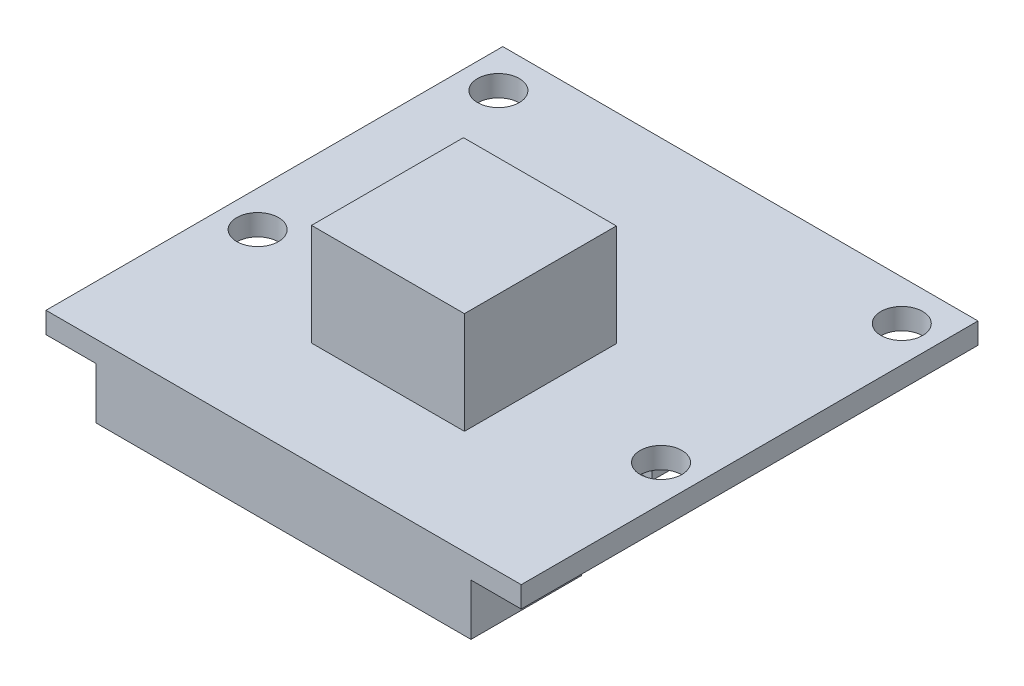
ISO-10303-21;
HEADER;
FILE_DESCRIPTION(('STEP AP214'),'2;1');
FILE_NAME('part.step','',(''),(''),'','','');
FILE_SCHEMA(('AUTOMOTIVE_DESIGN { 1 0 10303 214 1 1 1 1 }'));
ENDSEC;
DATA;
#1=APPLICATION_CONTEXT('core data for automotive mechanical design processes');
#2=APPLICATION_PROTOCOL_DEFINITION('international standard','automotive_design',2000,#1);
#3=PRODUCT_CONTEXT('',#1,'mechanical');
#4=PRODUCT('Part','Part','',(#3));
#5=PRODUCT_RELATED_PRODUCT_CATEGORY('part','',(#4));
#6=PRODUCT_DEFINITION_FORMATION('','',#4);
#7=PRODUCT_DEFINITION_CONTEXT('part definition',#1,'design');
#8=PRODUCT_DEFINITION('design','',#6,#7);
#9=PRODUCT_DEFINITION_SHAPE('','',#8);
#10=(LENGTH_UNIT() NAMED_UNIT(*) SI_UNIT(.MILLI.,.METRE.));
#11=(NAMED_UNIT(*) PLANE_ANGLE_UNIT() SI_UNIT($,.RADIAN.));
#12=(NAMED_UNIT(*) SI_UNIT($,.STERADIAN.) SOLID_ANGLE_UNIT());
#13=UNCERTAINTY_MEASURE_WITH_UNIT(LENGTH_MEASURE(1.E-05),#10,'distance_accuracy_value','');
#14=(GEOMETRIC_REPRESENTATION_CONTEXT(3) GLOBAL_UNCERTAINTY_ASSIGNED_CONTEXT((#13)) GLOBAL_UNIT_ASSIGNED_CONTEXT((#10,
#11,#12)) REPRESENTATION_CONTEXT('',''));
#15=CARTESIAN_POINT('',(0.,0.,0.));
#16=DIRECTION('',(0.,0.,1.));
#17=DIRECTION('',(1.,0.,0.));
#18=AXIS2_PLACEMENT_3D('',#15,#16,#17);
#19=CARTESIAN_POINT('',(0.,1.1049,0.));
#20=DIRECTION('',(0.,-1.,0.));
#21=DIRECTION('',(0.,0.,-1.));
#22=AXIS2_PLACEMENT_3D('',#19,#20,#21);
#23=PLANE('',#22);
#24=CARTESIAN_POINT('',(22.987,1.1049,-9.1948));
#25=DIRECTION('',(0.,1.,0.));
#26=DIRECTION('',(0.,0.,1.));
#27=AXIS2_PLACEMENT_3D('',#24,#25,#26);
#28=CIRCLE('',#27,1.0922);
#29=CARTESIAN_POINT('',(22.987,1.1049,-8.1026));
#30=VERTEX_POINT('',#29);
#31=EDGE_CURVE('E227',#30,#30,#28,.T.);
#32=ORIENTED_EDGE('',*,*,#31,.F.);
#33=EDGE_LOOP('',(#32));
#34=FACE_BOUND('',#33,.T.);
#35=CARTESIAN_POINT('',(22.987,1.1049,-21.7932));
#36=DIRECTION('',(0.,1.,0.));
#37=DIRECTION('',(0.,0.,1.));
#38=AXIS2_PLACEMENT_3D('',#35,#36,#37);
#39=CIRCLE('',#38,1.0922);
#40=CARTESIAN_POINT('',(22.987,1.1049,-20.701));
#41=VERTEX_POINT('',#40);
#42=EDGE_CURVE('E233',#41,#41,#39,.T.);
#43=ORIENTED_EDGE('',*,*,#42,.F.);
#44=EDGE_LOOP('',(#43));
#45=FACE_BOUND('',#44,.T.);
#46=CARTESIAN_POINT('',(1.8796,1.1049,-9.1948));
#47=DIRECTION('',(0.,1.,0.));
#48=DIRECTION('',(0.,0.,1.));
#49=AXIS2_PLACEMENT_3D('',#46,#47,#48);
#50=CIRCLE('',#49,1.0922);
#51=CARTESIAN_POINT('',(1.8796,1.1049,-8.1026));
#52=VERTEX_POINT('',#51);
#53=EDGE_CURVE('E239',#52,#52,#50,.T.);
#54=ORIENTED_EDGE('',*,*,#53,.F.);
#55=EDGE_LOOP('',(#54));
#56=FACE_BOUND('',#55,.T.);
#57=CARTESIAN_POINT('',(1.8796,1.1049,-21.7932));
#58=DIRECTION('',(0.,1.,0.));
#59=DIRECTION('',(0.,0.,1.));
#60=AXIS2_PLACEMENT_3D('',#57,#58,#59);
#61=CIRCLE('',#60,1.0922);
#62=CARTESIAN_POINT('',(1.8796,1.1049,-20.701));
#63=VERTEX_POINT('',#62);
#64=EDGE_CURVE('E245',#63,#63,#61,.T.);
#65=ORIENTED_EDGE('',*,*,#64,.F.);
#66=EDGE_LOOP('',(#65));
#67=FACE_BOUND('',#66,.T.);
#68=DIRECTION('',(0.,0.,1.));
#69=VECTOR('',#68,1.);
#70=CARTESIAN_POINT('',(0.,1.1049,0.));
#71=LINE('',#70,#69);
#72=CARTESIAN_POINT('',(0.,1.1049,-23.9014));
#73=VERTEX_POINT('',#72);
#74=CARTESIAN_POINT('',(0.,1.1049,0.));
#75=VERTEX_POINT('',#74);
#76=EDGE_CURVE('E251',#73,#75,#71,.T.);
#77=ORIENTED_EDGE('',*,*,#76,.T.);
#78=DIRECTION('',(1.,0.,0.));
#79=VECTOR('',#78,1.);
#80=CARTESIAN_POINT('',(0.,1.1049,0.));
#81=LINE('',#80,#79);
#82=CARTESIAN_POINT('',(24.8666,1.1049,0.));
#83=VERTEX_POINT('',#82);
#84=EDGE_CURVE('E254',#75,#83,#81,.T.);
#85=ORIENTED_EDGE('',*,*,#84,.T.);
#86=DIRECTION('',(0.,0.,-1.));
#87=VECTOR('',#86,1.);
#88=CARTESIAN_POINT('',(24.8666,1.1049,0.));
#89=LINE('',#88,#87);
#90=CARTESIAN_POINT('',(24.8666,1.1049,-23.9014));
#91=VERTEX_POINT('',#90);
#92=EDGE_CURVE('E257',#83,#91,#89,.T.);
#93=ORIENTED_EDGE('',*,*,#92,.T.);
#94=DIRECTION('',(-1.,0.,0.));
#95=VECTOR('',#94,1.);
#96=CARTESIAN_POINT('',(0.,1.1049,-23.9014));
#97=LINE('',#96,#95);
#98=EDGE_CURVE('E259',#91,#73,#97,.T.);
#99=ORIENTED_EDGE('',*,*,#98,.T.);
#100=EDGE_LOOP('',(#77,#85,#93,#99));
#101=FACE_BOUND('',#100,.T.);
#102=DIRECTION('',(0.,0.,1.));
#103=VECTOR('',#102,1.);
#104=CARTESIAN_POINT('',(8.4328,1.1049,-5.461));
#105=LINE('',#104,#103);
#106=CARTESIAN_POINT('',(8.4328,1.1049,-13.4112));
#107=VERTEX_POINT('',#106);
#108=CARTESIAN_POINT('',(8.4328,1.1049,-5.461));
#109=VERTEX_POINT('',#108);
#110=EDGE_CURVE('E165',#107,#109,#105,.T.);
#111=ORIENTED_EDGE('',*,*,#110,.F.);
#112=DIRECTION('',(-1.,0.,0.));
#113=VECTOR('',#112,1.);
#114=CARTESIAN_POINT('',(8.4328,1.1049,-13.4112));
#115=LINE('',#114,#113);
#116=CARTESIAN_POINT('',(16.4338,1.1049,-13.4112));
#117=VERTEX_POINT('',#116);
#118=EDGE_CURVE('E162',#117,#107,#115,.T.);
#119=ORIENTED_EDGE('',*,*,#118,.F.);
#120=DIRECTION('',(0.,0.,-1.));
#121=VECTOR('',#120,1.);
#122=CARTESIAN_POINT('',(16.4338,1.1049,-5.461));
#123=LINE('',#122,#121);
#124=CARTESIAN_POINT('',(16.4338,1.1049,-5.461));
#125=VERTEX_POINT('',#124);
#126=EDGE_CURVE('E52',#125,#117,#123,.T.);
#127=ORIENTED_EDGE('',*,*,#126,.F.);
#128=DIRECTION('',(1.,0.,0.));
#129=VECTOR('',#128,1.);
#130=CARTESIAN_POINT('',(8.4328,1.1049,-5.461));
#131=LINE('',#130,#129);
#132=EDGE_CURVE('E47',#109,#125,#131,.T.);
#133=ORIENTED_EDGE('',*,*,#132,.F.);
#134=EDGE_LOOP('',(#111,#119,#127,#133));
#135=FACE_BOUND('',#134,.T.);
#136=ADVANCED_FACE('F32',(#34,#45,#56,#67,#101,#135),#23,.F.);
#137=CARTESIAN_POINT('',(0.,0.,0.));
#138=DIRECTION('',(0.,-1.,0.));
#139=DIRECTION('',(0.,0.,-1.));
#140=AXIS2_PLACEMENT_3D('',#137,#138,#139);
#141=PLANE('',#140);
#142=CARTESIAN_POINT('',(22.987,0.,-21.7932));
#143=DIRECTION('',(0.,1.,0.));
#144=DIRECTION('',(0.,0.,1.));
#145=AXIS2_PLACEMENT_3D('',#142,#143,#144);
#146=CIRCLE('',#145,1.0922);
#147=CARTESIAN_POINT('',(22.987,0.,-20.701));
#148=VERTEX_POINT('',#147);
#149=EDGE_CURVE('E230',#148,#148,#146,.T.);
#150=ORIENTED_EDGE('',*,*,#149,.T.);
#151=EDGE_LOOP('',(#150));
#152=FACE_BOUND('',#151,.T.);
#153=CARTESIAN_POINT('',(1.8796,0.,-21.7932));
#154=DIRECTION('',(0.,1.,0.));
#155=DIRECTION('',(0.,0.,1.));
#156=AXIS2_PLACEMENT_3D('',#153,#154,#155);
#157=CIRCLE('',#156,1.0922);
#158=CARTESIAN_POINT('',(1.8796,0.,-20.701));
#159=VERTEX_POINT('',#158);
#160=EDGE_CURVE('E242',#159,#159,#157,.T.);
#161=ORIENTED_EDGE('',*,*,#160,.T.);
#162=EDGE_LOOP('',(#161));
#163=FACE_BOUND('',#162,.T.);
#164=CARTESIAN_POINT('',(1.8796,0.,-9.1948));
#165=DIRECTION('',(0.,1.,0.));
#166=DIRECTION('',(0.,0.,1.));
#167=AXIS2_PLACEMENT_3D('',#164,#165,#166);
#168=CIRCLE('',#167,1.0922);
#169=CARTESIAN_POINT('',(1.8796,0.,-8.1026));
#170=VERTEX_POINT('',#169);
#171=EDGE_CURVE('E236',#170,#170,#168,.T.);
#172=ORIENTED_EDGE('',*,*,#171,.T.);
#173=EDGE_LOOP('',(#172));
#174=FACE_BOUND('',#173,.T.);
#175=CARTESIAN_POINT('',(22.987,0.,-9.1948));
#176=DIRECTION('',(0.,1.,0.));
#177=DIRECTION('',(0.,0.,1.));
#178=AXIS2_PLACEMENT_3D('',#175,#176,#177);
#179=CIRCLE('',#178,1.0922);
#180=CARTESIAN_POINT('',(22.987,0.,-8.1026));
#181=VERTEX_POINT('',#180);
#182=EDGE_CURVE('E226',#181,#181,#179,.T.);
#183=ORIENTED_EDGE('',*,*,#182,.T.);
#184=EDGE_LOOP('',(#183));
#185=FACE_BOUND('',#184,.T.);
#186=DIRECTION('',(1.,0.,0.));
#187=VECTOR('',#186,1.);
#188=CARTESIAN_POINT('',(3.6703,0.,-22.1996));
#189=LINE('',#188,#187);
#190=CARTESIAN_POINT('',(3.6703,0.,-22.1996));
#191=VERTEX_POINT('',#190);
#192=CARTESIAN_POINT('',(21.1963,0.,-22.1996));
#193=VERTEX_POINT('',#192);
#194=EDGE_CURVE('E211',#191,#193,#189,.T.);
#195=ORIENTED_EDGE('',*,*,#194,.F.);
#196=DIRECTION('',(0.,0.,-1.));
#197=VECTOR('',#196,1.);
#198=CARTESIAN_POINT('',(3.6703,0.,-10.5156));
#199=LINE('',#198,#197);
#200=CARTESIAN_POINT('',(3.6703,0.,-10.5156));
#201=VERTEX_POINT('',#200);
#202=EDGE_CURVE('E197',#201,#191,#199,.T.);
#203=ORIENTED_EDGE('',*,*,#202,.F.);
#204=DIRECTION('',(-1.,0.,0.));
#205=VECTOR('',#204,1.);
#206=CARTESIAN_POINT('',(3.6703,0.,-10.5156));
#207=LINE('',#206,#205);
#208=CARTESIAN_POINT('',(21.1963,0.,-10.5156));
#209=VERTEX_POINT('',#208);
#210=EDGE_CURVE('E202',#209,#201,#207,.T.);
#211=ORIENTED_EDGE('',*,*,#210,.F.);
#212=DIRECTION('',(0.,0.,1.));
#213=VECTOR('',#212,1.);
#214=CARTESIAN_POINT('',(21.1963,0.,-10.5156));
#215=LINE('',#214,#213);
#216=EDGE_CURVE('E213',#193,#209,#215,.T.);
#217=ORIENTED_EDGE('',*,*,#216,.F.);
#218=EDGE_LOOP('',(#195,#203,#211,#217));
#219=FACE_BOUND('',#218,.T.);
#220=DIRECTION('',(1.,0.,0.));
#221=VECTOR('',#220,1.);
#222=CARTESIAN_POINT('',(0.,0.,0.));
#223=LINE('',#222,#221);
#224=CARTESIAN_POINT('',(22.2377,0.,0.));
#225=VERTEX_POINT('',#224);
#226=CARTESIAN_POINT('',(24.8666,0.,0.));
#227=VERTEX_POINT('',#226);
#228=EDGE_CURVE('E264',#225,#227,#223,.T.);
#229=ORIENTED_EDGE('',*,*,#228,.F.);
#230=DIRECTION('',(0.,0.,1.));
#231=VECTOR('',#230,1.);
#232=CARTESIAN_POINT('',(22.2377,0.,0.));
#233=LINE('',#232,#231);
#234=CARTESIAN_POINT('',(22.2377,0.,-5.7785));
#235=VERTEX_POINT('',#234);
#236=EDGE_CURVE('E166',#235,#225,#233,.T.);
#237=ORIENTED_EDGE('',*,*,#236,.F.);
#238=DIRECTION('',(1.,0.,0.));
#239=VECTOR('',#238,1.);
#240=CARTESIAN_POINT('',(22.2377,0.,-5.7785));
#241=LINE('',#240,#239);
#242=CARTESIAN_POINT('',(2.6289,0.,-5.7785));
#243=VERTEX_POINT('',#242);
#244=EDGE_CURVE('E178',#243,#235,#241,.T.);
#245=ORIENTED_EDGE('',*,*,#244,.F.);
#246=DIRECTION('',(0.,0.,-1.));
#247=VECTOR('',#246,1.);
#248=CARTESIAN_POINT('',(2.6289,0.,0.));
#249=LINE('',#248,#247);
#250=CARTESIAN_POINT('',(2.6289,0.,0.));
#251=VERTEX_POINT('',#250);
#252=EDGE_CURVE('E168',#251,#243,#249,.T.);
#253=ORIENTED_EDGE('',*,*,#252,.F.);
#254=CARTESIAN_POINT('',(0.,0.,0.));
#255=VERTEX_POINT('',#254);
#256=EDGE_CURVE('E265',#255,#251,#223,.T.);
#257=ORIENTED_EDGE('',*,*,#256,.F.);
#258=DIRECTION('',(0.,0.,1.));
#259=VECTOR('',#258,1.);
#260=CARTESIAN_POINT('',(0.,0.,0.));
#261=LINE('',#260,#259);
#262=CARTESIAN_POINT('',(0.,0.,-23.9014));
#263=VERTEX_POINT('',#262);
#264=EDGE_CURVE('E248',#263,#255,#261,.T.);
#265=ORIENTED_EDGE('',*,*,#264,.F.);
#266=DIRECTION('',(-1.,0.,0.));
#267=VECTOR('',#266,1.);
#268=CARTESIAN_POINT('',(0.,0.,-23.9014));
#269=LINE('',#268,#267);
#270=CARTESIAN_POINT('',(24.8666,0.,-23.9014));
#271=VERTEX_POINT('',#270);
#272=EDGE_CURVE('E255',#271,#263,#269,.T.);
#273=ORIENTED_EDGE('',*,*,#272,.F.);
#274=DIRECTION('',(0.,0.,-1.));
#275=VECTOR('',#274,1.);
#276=CARTESIAN_POINT('',(24.8666,0.,0.));
#277=LINE('',#276,#275);
#278=EDGE_CURVE('E268',#227,#271,#277,.T.);
#279=ORIENTED_EDGE('',*,*,#278,.F.);
#280=EDGE_LOOP('',(#229,#237,#245,#253,#257,#265,#273,#279));
#281=FACE_BOUND('',#280,.T.);
#282=ADVANCED_FACE('F286',(#152,#163,#174,#185,#219,#281),#141,.T.);
#283=CARTESIAN_POINT('',(0.,1.1049,0.));
#284=DIRECTION('',(1.,0.,0.));
#285=DIRECTION('',(0.,0.,-1.));
#286=AXIS2_PLACEMENT_3D('',#283,#284,#285);
#287=PLANE('',#286);
#288=ORIENTED_EDGE('',*,*,#264,.T.);
#289=DIRECTION('',(0.,-1.,0.));
#290=VECTOR('',#289,1.);
#291=CARTESIAN_POINT('',(0.,1.1049,0.));
#292=LINE('',#291,#290);
#293=EDGE_CURVE('E11',#75,#255,#292,.T.);
#294=ORIENTED_EDGE('',*,*,#293,.F.);
#295=ORIENTED_EDGE('',*,*,#76,.F.);
#296=DIRECTION('',(0.,-1.,0.));
#297=VECTOR('',#296,1.);
#298=CARTESIAN_POINT('',(0.,1.1049,-23.9014));
#299=LINE('',#298,#297);
#300=EDGE_CURVE('E261',#73,#263,#299,.T.);
#301=ORIENTED_EDGE('',*,*,#300,.T.);
#302=EDGE_LOOP('',(#288,#294,#295,#301));
#303=FACE_BOUND('',#302,.T.);
#304=ADVANCED_FACE('F34',(#303),#287,.F.);
#305=CARTESIAN_POINT('',(0.,1.1049,0.));
#306=DIRECTION('',(0.,0.,-1.));
#307=DIRECTION('',(-1.,0.,0.));
#308=AXIS2_PLACEMENT_3D('',#305,#306,#307);
#309=PLANE('',#308);
#310=ORIENTED_EDGE('',*,*,#256,.T.);
#311=DIRECTION('',(0.,1.,0.));
#312=VECTOR('',#311,1.);
#313=CARTESIAN_POINT('',(2.6289,-2.6924,0.));
#314=LINE('',#313,#312);
#315=CARTESIAN_POINT('',(2.6289,-2.6924,0.));
#316=VERTEX_POINT('',#315);
#317=EDGE_CURVE('E192',#316,#251,#314,.T.);
#318=ORIENTED_EDGE('',*,*,#317,.F.);
#319=DIRECTION('',(-1.,0.,0.));
#320=VECTOR('',#319,1.);
#321=CARTESIAN_POINT('',(22.2377,-2.6924,0.));
#322=LINE('',#321,#320);
#323=CARTESIAN_POINT('',(22.2377,-2.6924,0.));
#324=VERTEX_POINT('',#323);
#325=EDGE_CURVE('E177',#324,#316,#322,.T.);
#326=ORIENTED_EDGE('',*,*,#325,.F.);
#327=DIRECTION('',(0.,1.,0.));
#328=VECTOR('',#327,1.);
#329=CARTESIAN_POINT('',(22.2377,-2.6924,0.));
#330=LINE('',#329,#328);
#331=EDGE_CURVE('E194',#324,#225,#330,.T.);
#332=ORIENTED_EDGE('',*,*,#331,.T.);
#333=ORIENTED_EDGE('',*,*,#228,.T.);
#334=DIRECTION('',(0.,-1.,0.));
#335=VECTOR('',#334,1.);
#336=CARTESIAN_POINT('',(24.8666,1.1049,0.));
#337=LINE('',#336,#335);
#338=EDGE_CURVE('E40',#83,#227,#337,.T.);
#339=ORIENTED_EDGE('',*,*,#338,.F.);
#340=ORIENTED_EDGE('',*,*,#84,.F.);
#341=ORIENTED_EDGE('',*,*,#293,.T.);
#342=EDGE_LOOP('',(#310,#318,#326,#332,#333,#339,#340,#341));
#343=FACE_BOUND('',#342,.T.);
#344=ADVANCED_FACE('F297',(#343),#309,.F.);
#345=CARTESIAN_POINT('',(24.8666,1.1049,0.));
#346=DIRECTION('',(-1.,0.,0.));
#347=DIRECTION('',(0.,0.,1.));
#348=AXIS2_PLACEMENT_3D('',#345,#346,#347);
#349=PLANE('',#348);
#350=ORIENTED_EDGE('',*,*,#278,.T.);
#351=DIRECTION('',(0.,-1.,0.));
#352=VECTOR('',#351,1.);
#353=CARTESIAN_POINT('',(24.8666,1.1049,-23.9014));
#354=LINE('',#353,#352);
#355=EDGE_CURVE('E273',#91,#271,#354,.T.);
#356=ORIENTED_EDGE('',*,*,#355,.F.);
#357=ORIENTED_EDGE('',*,*,#92,.F.);
#358=ORIENTED_EDGE('',*,*,#338,.T.);
#359=EDGE_LOOP('',(#350,#356,#357,#358));
#360=FACE_BOUND('',#359,.T.);
#361=ADVANCED_FACE('F280',(#360),#349,.F.);
#362=CARTESIAN_POINT('',(0.,1.1049,-23.9014));
#363=DIRECTION('',(0.,0.,1.));
#364=DIRECTION('',(1.,0.,0.));
#365=AXIS2_PLACEMENT_3D('',#362,#363,#364);
#366=PLANE('',#365);
#367=ORIENTED_EDGE('',*,*,#272,.T.);
#368=ORIENTED_EDGE('',*,*,#300,.F.);
#369=ORIENTED_EDGE('',*,*,#98,.F.);
#370=ORIENTED_EDGE('',*,*,#355,.T.);
#371=EDGE_LOOP('',(#367,#368,#369,#370));
#372=FACE_BOUND('',#371,.T.);
#373=ADVANCED_FACE('F291',(#372),#366,.F.);
#374=CARTESIAN_POINT('',(1.8796,1.1049,-21.7932));
#375=DIRECTION('',(0.,-1.,0.));
#376=DIRECTION('',(0.,0.,-1.));
#377=AXIS2_PLACEMENT_3D('',#374,#375,#376);
#378=CYLINDRICAL_SURFACE('',#377,1.0922);
#379=ORIENTED_EDGE('',*,*,#64,.T.);
#380=EDGE_LOOP('',(#379));
#381=FACE_BOUND('',#380,.T.);
#382=ORIENTED_EDGE('',*,*,#160,.F.);
#383=EDGE_LOOP('',(#382));
#384=FACE_BOUND('',#383,.T.);
#385=ADVANCED_FACE('F337',(#381,#384),#378,.F.);
#386=CARTESIAN_POINT('',(1.8796,1.1049,-9.1948));
#387=DIRECTION('',(0.,-1.,0.));
#388=DIRECTION('',(0.,0.,-1.));
#389=AXIS2_PLACEMENT_3D('',#386,#387,#388);
#390=CYLINDRICAL_SURFACE('',#389,1.0922);
#391=ORIENTED_EDGE('',*,*,#53,.T.);
#392=EDGE_LOOP('',(#391));
#393=FACE_BOUND('',#392,.T.);
#394=ORIENTED_EDGE('',*,*,#171,.F.);
#395=EDGE_LOOP('',(#394));
#396=FACE_BOUND('',#395,.T.);
#397=ADVANCED_FACE('F471',(#393,#396),#390,.F.);
#398=CARTESIAN_POINT('',(22.987,1.1049,-21.7932));
#399=DIRECTION('',(0.,-1.,0.));
#400=DIRECTION('',(0.,0.,-1.));
#401=AXIS2_PLACEMENT_3D('',#398,#399,#400);
#402=CYLINDRICAL_SURFACE('',#401,1.0922);
#403=ORIENTED_EDGE('',*,*,#42,.T.);
#404=EDGE_LOOP('',(#403));
#405=FACE_BOUND('',#404,.T.);
#406=ORIENTED_EDGE('',*,*,#149,.F.);
#407=EDGE_LOOP('',(#406));
#408=FACE_BOUND('',#407,.T.);
#409=ADVANCED_FACE('F479',(#405,#408),#402,.F.);
#410=CARTESIAN_POINT('',(22.987,1.1049,-9.1948));
#411=DIRECTION('',(0.,-1.,0.));
#412=DIRECTION('',(0.,0.,-1.));
#413=AXIS2_PLACEMENT_3D('',#410,#411,#412);
#414=CYLINDRICAL_SURFACE('',#413,1.0922);
#415=ORIENTED_EDGE('',*,*,#31,.T.);
#416=EDGE_LOOP('',(#415));
#417=FACE_BOUND('',#416,.T.);
#418=ORIENTED_EDGE('',*,*,#182,.F.);
#419=EDGE_LOOP('',(#418));
#420=FACE_BOUND('',#419,.T.);
#421=ADVANCED_FACE('F487',(#417,#420),#414,.F.);
#422=CARTESIAN_POINT('',(3.6703,-1.27,-10.5156));
#423=DIRECTION('',(1.,0.,0.));
#424=DIRECTION('',(0.,0.,-1.));
#425=AXIS2_PLACEMENT_3D('',#422,#423,#424);
#426=PLANE('',#425);
#427=ORIENTED_EDGE('',*,*,#202,.T.);
#428=DIRECTION('',(0.,1.,0.));
#429=VECTOR('',#428,1.);
#430=CARTESIAN_POINT('',(3.6703,-1.27,-22.1996));
#431=LINE('',#430,#429);
#432=CARTESIAN_POINT('',(3.6703,-1.27,-22.1996));
#433=VERTEX_POINT('',#432);
#434=EDGE_CURVE('E224',#433,#191,#431,.T.);
#435=ORIENTED_EDGE('',*,*,#434,.F.);
#436=DIRECTION('',(0.,0.,-1.));
#437=VECTOR('',#436,1.);
#438=CARTESIAN_POINT('',(3.6703,-1.27,-10.5156));
#439=LINE('',#438,#437);
#440=CARTESIAN_POINT('',(3.6703,-1.27,-10.5156));
#441=VERTEX_POINT('',#440);
#442=EDGE_CURVE('E198',#441,#433,#439,.T.);
#443=ORIENTED_EDGE('',*,*,#442,.F.);
#444=DIRECTION('',(0.,1.,0.));
#445=VECTOR('',#444,1.);
#446=CARTESIAN_POINT('',(3.6703,-1.27,-10.5156));
#447=LINE('',#446,#445);
#448=EDGE_CURVE('E208',#441,#201,#447,.T.);
#449=ORIENTED_EDGE('',*,*,#448,.T.);
#450=EDGE_LOOP('',(#427,#435,#443,#449));
#451=FACE_BOUND('',#450,.T.);
#452=ADVANCED_FACE('F496',(#451),#426,.F.);
#453=CARTESIAN_POINT('',(3.6703,-1.27,-22.1996));
#454=DIRECTION('',(0.,0.,1.));
#455=DIRECTION('',(1.,0.,0.));
#456=AXIS2_PLACEMENT_3D('',#453,#454,#455);
#457=PLANE('',#456);
#458=ORIENTED_EDGE('',*,*,#194,.T.);
#459=DIRECTION('',(0.,1.,0.));
#460=VECTOR('',#459,1.);
#461=CARTESIAN_POINT('',(21.1963,-1.27,-22.1996));
#462=LINE('',#461,#460);
#463=CARTESIAN_POINT('',(21.1963,-1.27,-22.1996));
#464=VERTEX_POINT('',#463);
#465=EDGE_CURVE('E221',#464,#193,#462,.T.);
#466=ORIENTED_EDGE('',*,*,#465,.F.);
#467=DIRECTION('',(1.,0.,0.));
#468=VECTOR('',#467,1.);
#469=CARTESIAN_POINT('',(3.6703,-1.27,-22.1996));
#470=LINE('',#469,#468);
#471=EDGE_CURVE('E201',#433,#464,#470,.T.);
#472=ORIENTED_EDGE('',*,*,#471,.F.);
#473=ORIENTED_EDGE('',*,*,#434,.T.);
#474=EDGE_LOOP('',(#458,#466,#472,#473));
#475=FACE_BOUND('',#474,.T.);
#476=ADVANCED_FACE('F505',(#475),#457,.F.);
#477=CARTESIAN_POINT('',(21.1963,-1.27,-10.5156));
#478=DIRECTION('',(-1.,0.,0.));
#479=DIRECTION('',(0.,0.,1.));
#480=AXIS2_PLACEMENT_3D('',#477,#478,#479);
#481=PLANE('',#480);
#482=ORIENTED_EDGE('',*,*,#216,.T.);
#483=DIRECTION('',(0.,1.,0.));
#484=VECTOR('',#483,1.);
#485=CARTESIAN_POINT('',(21.1963,-1.27,-10.5156));
#486=LINE('',#485,#484);
#487=CARTESIAN_POINT('',(21.1963,-1.27,-10.5156));
#488=VERTEX_POINT('',#487);
#489=EDGE_CURVE('E219',#488,#209,#486,.T.);
#490=ORIENTED_EDGE('',*,*,#489,.F.);
#491=DIRECTION('',(0.,0.,1.));
#492=VECTOR('',#491,1.);
#493=CARTESIAN_POINT('',(21.1963,-1.27,-10.5156));
#494=LINE('',#493,#492);
#495=EDGE_CURVE('E204',#464,#488,#494,.T.);
#496=ORIENTED_EDGE('',*,*,#495,.F.);
#497=ORIENTED_EDGE('',*,*,#465,.T.);
#498=EDGE_LOOP('',(#482,#490,#496,#497));
#499=FACE_BOUND('',#498,.T.);
#500=ADVANCED_FACE('F514',(#499),#481,.F.);
#501=CARTESIAN_POINT('',(3.6703,-1.27,-10.5156));
#502=DIRECTION('',(0.,0.,-1.));
#503=DIRECTION('',(-1.,0.,0.));
#504=AXIS2_PLACEMENT_3D('',#501,#502,#503);
#505=PLANE('',#504);
#506=ORIENTED_EDGE('',*,*,#210,.T.);
#507=ORIENTED_EDGE('',*,*,#448,.F.);
#508=DIRECTION('',(-1.,0.,0.));
#509=VECTOR('',#508,1.);
#510=CARTESIAN_POINT('',(3.6703,-1.27,-10.5156));
#511=LINE('',#510,#509);
#512=EDGE_CURVE('E206',#488,#441,#511,.T.);
#513=ORIENTED_EDGE('',*,*,#512,.F.);
#514=ORIENTED_EDGE('',*,*,#489,.T.);
#515=EDGE_LOOP('',(#506,#507,#513,#514));
#516=FACE_BOUND('',#515,.T.);
#517=ADVANCED_FACE('F323',(#516),#505,.F.);
#518=CARTESIAN_POINT('',(0.,-1.27,0.));
#519=DIRECTION('',(0.,-1.,0.));
#520=DIRECTION('',(0.,0.,-1.));
#521=AXIS2_PLACEMENT_3D('',#518,#519,#520);
#522=PLANE('',#521);
#523=ORIENTED_EDGE('',*,*,#442,.T.);
#524=ORIENTED_EDGE('',*,*,#471,.T.);
#525=ORIENTED_EDGE('',*,*,#495,.T.);
#526=ORIENTED_EDGE('',*,*,#512,.T.);
#527=EDGE_LOOP('',(#523,#524,#525,#526));
#528=FACE_BOUND('',#527,.T.);
#529=ADVANCED_FACE('F316',(#528),#522,.T.);
#530=CARTESIAN_POINT('',(22.2377,-2.6924,0.));
#531=DIRECTION('',(-1.,0.,0.));
#532=DIRECTION('',(0.,0.,1.));
#533=AXIS2_PLACEMENT_3D('',#530,#531,#532);
#534=PLANE('',#533);
#535=ORIENTED_EDGE('',*,*,#236,.T.);
#536=ORIENTED_EDGE('',*,*,#331,.F.);
#537=DIRECTION('',(0.,0.,1.));
#538=VECTOR('',#537,1.);
#539=CARTESIAN_POINT('',(22.2377,-2.6924,0.));
#540=LINE('',#539,#538);
#541=CARTESIAN_POINT('',(22.2377,-2.6924,-5.7785));
#542=VERTEX_POINT('',#541);
#543=EDGE_CURVE('E174',#542,#324,#540,.T.);
#544=ORIENTED_EDGE('',*,*,#543,.F.);
#545=DIRECTION('',(0.,1.,0.));
#546=VECTOR('',#545,1.);
#547=CARTESIAN_POINT('',(22.2377,-2.6924,-5.7785));
#548=LINE('',#547,#546);
#549=EDGE_CURVE('E183',#542,#235,#548,.T.);
#550=ORIENTED_EDGE('',*,*,#549,.T.);
#551=EDGE_LOOP('',(#535,#536,#544,#550));
#552=FACE_BOUND('',#551,.T.);
#553=ADVANCED_FACE('F314',(#552),#534,.F.);
#554=CARTESIAN_POINT('',(2.6289,-2.6924,0.));
#555=DIRECTION('',(1.,0.,0.));
#556=DIRECTION('',(0.,0.,-1.));
#557=AXIS2_PLACEMENT_3D('',#554,#555,#556);
#558=PLANE('',#557);
#559=ORIENTED_EDGE('',*,*,#252,.T.);
#560=DIRECTION('',(0.,1.,0.));
#561=VECTOR('',#560,1.);
#562=CARTESIAN_POINT('',(2.6289,-2.6924,-5.7785));
#563=LINE('',#562,#561);
#564=CARTESIAN_POINT('',(2.6289,-2.6924,-5.7785));
#565=VERTEX_POINT('',#564);
#566=EDGE_CURVE('E189',#565,#243,#563,.T.);
#567=ORIENTED_EDGE('',*,*,#566,.F.);
#568=DIRECTION('',(0.,0.,-1.));
#569=VECTOR('',#568,1.);
#570=CARTESIAN_POINT('',(2.6289,-2.6924,0.));
#571=LINE('',#570,#569);
#572=EDGE_CURVE('E180',#316,#565,#571,.T.);
#573=ORIENTED_EDGE('',*,*,#572,.F.);
#574=ORIENTED_EDGE('',*,*,#317,.T.);
#575=EDGE_LOOP('',(#559,#567,#573,#574));
#576=FACE_BOUND('',#575,.T.);
#577=ADVANCED_FACE('F304',(#576),#558,.F.);
#578=CARTESIAN_POINT('',(22.2377,-2.6924,-5.7785));
#579=DIRECTION('',(0.,0.,1.));
#580=DIRECTION('',(1.,0.,0.));
#581=AXIS2_PLACEMENT_3D('',#578,#579,#580);
#582=PLANE('',#581);
#583=ORIENTED_EDGE('',*,*,#244,.T.);
#584=ORIENTED_EDGE('',*,*,#549,.F.);
#585=DIRECTION('',(1.,0.,0.));
#586=VECTOR('',#585,1.);
#587=CARTESIAN_POINT('',(22.2377,-2.6924,-5.7785));
#588=LINE('',#587,#586);
#589=EDGE_CURVE('E182',#565,#542,#588,.T.);
#590=ORIENTED_EDGE('',*,*,#589,.F.);
#591=ORIENTED_EDGE('',*,*,#566,.T.);
#592=EDGE_LOOP('',(#583,#584,#590,#591));
#593=FACE_BOUND('',#592,.T.);
#594=ADVANCED_FACE('F307',(#593),#582,.F.);
#595=CARTESIAN_POINT('',(0.,-2.6924,0.));
#596=DIRECTION('',(0.,1.,0.));
#597=DIRECTION('',(0.,0.,1.));
#598=AXIS2_PLACEMENT_3D('',#595,#596,#597);
#599=PLANE('',#598);
#600=ORIENTED_EDGE('',*,*,#543,.T.);
#601=ORIENTED_EDGE('',*,*,#325,.T.);
#602=ORIENTED_EDGE('',*,*,#572,.T.);
#603=ORIENTED_EDGE('',*,*,#589,.T.);
#604=EDGE_LOOP('',(#600,#601,#602,#603));
#605=FACE_BOUND('',#604,.T.);
#606=ADVANCED_FACE('F311',(#605),#599,.F.);
#607=CARTESIAN_POINT('',(8.4328,6.4389,-5.461));
#608=DIRECTION('',(1.,0.,0.));
#609=DIRECTION('',(0.,0.,-1.));
#610=AXIS2_PLACEMENT_3D('',#607,#608,#609);
#611=PLANE('',#610);
#612=ORIENTED_EDGE('',*,*,#110,.T.);
#613=DIRECTION('',(0.,-1.,0.));
#614=VECTOR('',#613,1.);
#615=CARTESIAN_POINT('',(8.4328,6.4389,-5.461));
#616=LINE('',#615,#614);
#617=CARTESIAN_POINT('',(8.4328,6.4389,-5.461));
#618=VERTEX_POINT('',#617);
#619=EDGE_CURVE('E146',#618,#109,#616,.T.);
#620=ORIENTED_EDGE('',*,*,#619,.F.);
#621=DIRECTION('',(0.,0.,1.));
#622=VECTOR('',#621,1.);
#623=CARTESIAN_POINT('',(8.4328,6.4389,-5.461));
#624=LINE('',#623,#622);
#625=CARTESIAN_POINT('',(8.4328,6.4389,-13.4112));
#626=VERTEX_POINT('',#625);
#627=EDGE_CURVE('E153',#626,#618,#624,.T.);
#628=ORIENTED_EDGE('',*,*,#627,.F.);
#629=DIRECTION('',(0.,-1.,0.));
#630=VECTOR('',#629,1.);
#631=CARTESIAN_POINT('',(8.4328,6.4389,-13.4112));
#632=LINE('',#631,#630);
#633=EDGE_CURVE('E443',#626,#107,#632,.T.);
#634=ORIENTED_EDGE('',*,*,#633,.T.);
#635=EDGE_LOOP('',(#612,#620,#628,#634));
#636=FACE_BOUND('',#635,.T.);
#637=ADVANCED_FACE('F164',(#636),#611,.F.);
#638=CARTESIAN_POINT('',(8.4328,6.4389,-5.461));
#639=DIRECTION('',(0.,0.,-1.));
#640=DIRECTION('',(-1.,0.,0.));
#641=AXIS2_PLACEMENT_3D('',#638,#639,#640);
#642=PLANE('',#641);
#643=ORIENTED_EDGE('',*,*,#132,.T.);
#644=DIRECTION('',(0.,-1.,0.));
#645=VECTOR('',#644,1.);
#646=CARTESIAN_POINT('',(16.4338,6.4389,-5.461));
#647=LINE('',#646,#645);
#648=CARTESIAN_POINT('',(16.4338,6.4389,-5.461));
#649=VERTEX_POINT('',#648);
#650=EDGE_CURVE('E149',#649,#125,#647,.T.);
#651=ORIENTED_EDGE('',*,*,#650,.F.);
#652=DIRECTION('',(1.,0.,0.));
#653=VECTOR('',#652,1.);
#654=CARTESIAN_POINT('',(8.4328,6.4389,-5.461));
#655=LINE('',#654,#653);
#656=EDGE_CURVE('E142',#618,#649,#655,.T.);
#657=ORIENTED_EDGE('',*,*,#656,.F.);
#658=ORIENTED_EDGE('',*,*,#619,.T.);
#659=EDGE_LOOP('',(#643,#651,#657,#658));
#660=FACE_BOUND('',#659,.T.);
#661=ADVANCED_FACE('F144',(#660),#642,.F.);
#662=CARTESIAN_POINT('',(16.4338,6.4389,-5.461));
#663=DIRECTION('',(-1.,0.,0.));
#664=DIRECTION('',(0.,0.,1.));
#665=AXIS2_PLACEMENT_3D('',#662,#663,#664);
#666=PLANE('',#665);
#667=ORIENTED_EDGE('',*,*,#126,.T.);
#668=DIRECTION('',(0.,-1.,0.));
#669=VECTOR('',#668,1.);
#670=CARTESIAN_POINT('',(16.4338,6.4389,-13.4112));
#671=LINE('',#670,#669);
#672=CARTESIAN_POINT('',(16.4338,6.4389,-13.4112));
#673=VERTEX_POINT('',#672);
#674=EDGE_CURVE('E170',#673,#117,#671,.T.);
#675=ORIENTED_EDGE('',*,*,#674,.F.);
#676=DIRECTION('',(0.,0.,-1.));
#677=VECTOR('',#676,1.);
#678=CARTESIAN_POINT('',(16.4338,6.4389,-5.461));
#679=LINE('',#678,#677);
#680=EDGE_CURVE('E152',#649,#673,#679,.T.);
#681=ORIENTED_EDGE('',*,*,#680,.F.);
#682=ORIENTED_EDGE('',*,*,#650,.T.);
#683=EDGE_LOOP('',(#667,#675,#681,#682));
#684=FACE_BOUND('',#683,.T.);
#685=ADVANCED_FACE('F410',(#684),#666,.F.);
#686=CARTESIAN_POINT('',(8.4328,6.4389,-13.4112));
#687=DIRECTION('',(0.,0.,1.));
#688=DIRECTION('',(1.,0.,0.));
#689=AXIS2_PLACEMENT_3D('',#686,#687,#688);
#690=PLANE('',#689);
#691=ORIENTED_EDGE('',*,*,#118,.T.);
#692=ORIENTED_EDGE('',*,*,#633,.F.);
#693=DIRECTION('',(-1.,0.,0.));
#694=VECTOR('',#693,1.);
#695=CARTESIAN_POINT('',(8.4328,6.4389,-13.4112));
#696=LINE('',#695,#694);
#697=EDGE_CURVE('E158',#673,#626,#696,.T.);
#698=ORIENTED_EDGE('',*,*,#697,.F.);
#699=ORIENTED_EDGE('',*,*,#674,.T.);
#700=EDGE_LOOP('',(#691,#692,#698,#699));
#701=FACE_BOUND('',#700,.T.);
#702=ADVANCED_FACE('F419',(#701),#690,.F.);
#703=CARTESIAN_POINT('',(0.,6.4389,0.));
#704=DIRECTION('',(0.,-1.,0.));
#705=DIRECTION('',(0.,0.,-1.));
#706=AXIS2_PLACEMENT_3D('',#703,#704,#705);
#707=PLANE('',#706);
#708=ORIENTED_EDGE('',*,*,#627,.T.);
#709=ORIENTED_EDGE('',*,*,#656,.T.);
#710=ORIENTED_EDGE('',*,*,#680,.T.);
#711=ORIENTED_EDGE('',*,*,#697,.T.);
#712=EDGE_LOOP('',(#708,#709,#710,#711));
#713=FACE_BOUND('',#712,.T.);
#714=ADVANCED_FACE('F156',(#713),#707,.F.);
#715=CLOSED_SHELL('',(#136,#282,#304,#344,#361,#373,#385,#397,#409,#421,#452,#476,#500,#517,
#529,#553,#577,#594,#606,#637,#661,#685,#702,#714));
#716=MANIFOLD_SOLID_BREP('B2',#715);
#717=ADVANCED_BREP_SHAPE_REPRESENTATION('',(#18,#716),#14);
#718=SHAPE_DEFINITION_REPRESENTATION(#9,#717);
ENDSEC;
END-ISO-10303-21;
